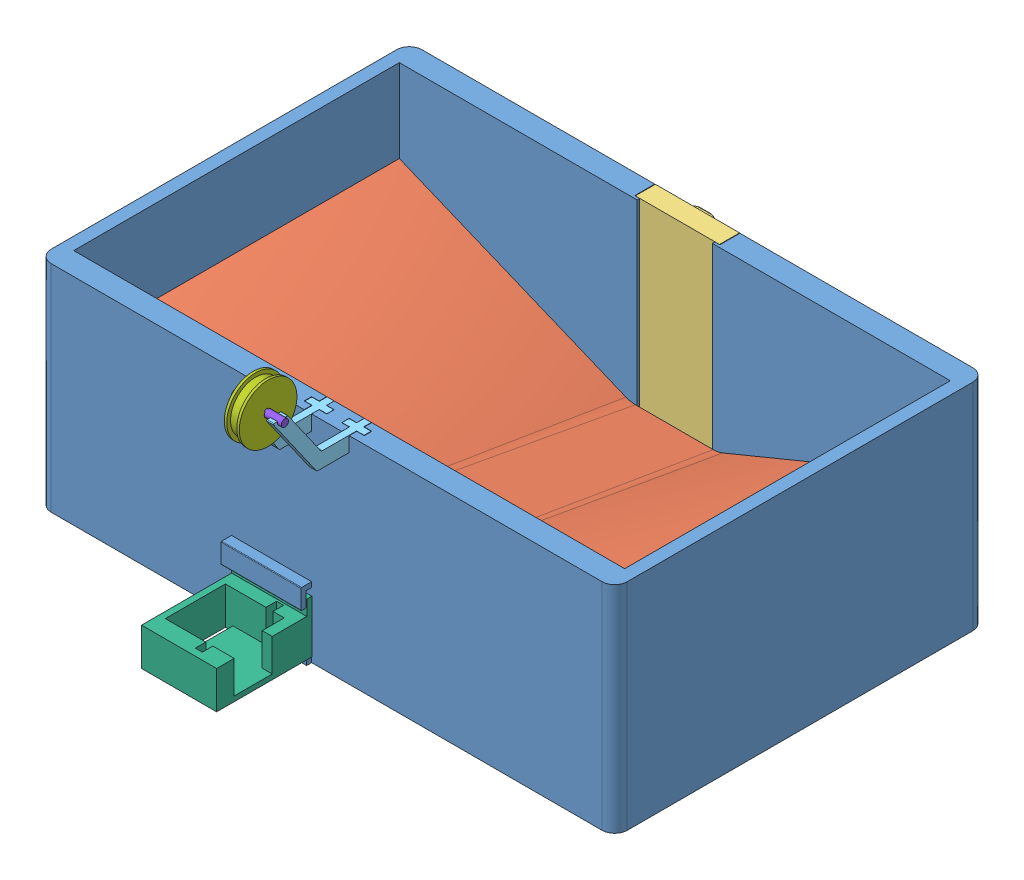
SolidWorks assembly insgesamt.SLDASM, configuration 默认 (file format 6000). Lengths in mm.
Overall size (230 119.92 193.93).
11 component instances, 8 part files, 11 mates.
Components (placement in the parent):
- box-1-1: box-1.SLDPRT [默认] at (-11.9703 -29.3033 229.9) size (230 86 152.2)
- schiefer-1: schiefer.SLDPRT [默认] at (-11.7703 -16.0671 294.9) size (219.6 40 129.6)
- tuer-1-1: tuer-1.SLDPRT [默认] at (-28.7703 -21.3003 163.897) x (1 0 0) z (0 0.000747 1) size (33.6 86 11.5)
- achse-1: achse.SLDPRT [默认] at (-28.9398 -25.3033 159.9) x (1 0 0) z (0 0.347763 0.937582) size (9 5.1 5.1)
- achse-2: achse.SLDPRT [默认] at (4.7017 -25.3033 159.9) x (-1 0 0) z (0 -0.995401 0.095798) size (9 5.1 5.1)
- stange-1: stange.SLDPRT [默认] at (-4.531 50.6967 294.9) size (8.8 25 39.07)
- stange-2: stange.SLDPRT [默认] at (-19.4095 50.6967 294.9) size (8.8 25 39.07)
- motor-box-3-1: motor-box-3.SLDPRT [默认] at (-32.9025 -27.2839 322.9) x (-1 0 0) z (0 0 -1) size (30 23 38)
- rad-oben-1: rad-oben.SLDASM [默认] at (-15.0948 85.3765 310.2291) x (1 0 0) z (0 -0.445497 0.895283) size (20 23 23)
  - rad-2-1: rad-2.SLDPRT [默认] at (3.694 0.0745 23) size (6 23 23)
  - achse-1-1: achse-1.SLDPRT [默认] at (3.3991 0.0745 23) size (20 3.41 2.9)
Mates (geometry in assembly coordinates):
- 同心1: concentric anti-aligned: cylinder of box-1-1 through (6.0297 -25.3033 159.9) axis (-1 0 0) radius 1.7; cylinder of tuer-1-1 through (-24.4703 -25.3033 159.9) axis (1 0 0) radius 2.75
- 距离4: distance = 0.2 mm anti-aligned: plane of tuer-1-1 through (4.8297 -21.3063 155.897) normal (1 0 0); plane of box-1-1 through (5.0297 56.6967 163.9) normal (-1 0 0)
- 同心2: concentric anti-aligned: cylinder of tuer-1-1 through (-24.4703 -25.3033 159.9) axis (1 0 0) radius 2.75; cylinder of achse-1 through (-19.9398 -25.3033 159.9) axis (-1 0 0) radius 2.55
- 同心3: concentric anti-aligned: cylinder of box-1-1 through (6.0297 -25.3033 159.9) axis (-1 0 0) radius 1.7; cylinder of achse-2 through (-4.2983 -25.3033 159.9) axis (1 0 0) radius 2.55
- 重合6: coincident aligned: plane of box-1-1 through (-121.9703 -29.3033 294.9) normal (0 0 -1); plane of stange-1 through (-3.131 50.6967 294.9) normal (0 0 -1)
- 重合7: coincident aligned: plane of box-1-1 through (-11.9703 56.6967 229.9) normal (0 1 0); plane of stange-1 through (-3.131 56.6967 294.9) normal (0 1 0)
- 重合8: coincident anti-aligned: plane of box-1-1 through (-126.9703 -29.3033 303.9) normal (0 0 1); plane of motor-box-3-1 through (-17.9025 -12.2839 303.9) normal (0 0 -1)
- 平行1: parallel aligned: plane of box-1-1 through (-11.9703 -29.3033 229.9) normal (0 -1 0); plane of motor-box-3-1 through (-32.9025 -27.2839 322.9) normal (0 -1 0)
- 重合11: coincident anti-aligned: plane of box-1-1 through (98.0297 -29.3033 164.9) normal (-1 0 0); plane of schiefer-1 through (98.0297 -16.0671 294.9) normal (1 0 0)
- 重合12: coincident anti-aligned: plane of box-1-1 through (-121.9703 -29.3033 294.9) normal (0 0 -1); plane of schiefer-1 through (5.7297 8.7849 294.9) normal (0 0 1)
- 同心4: concentric aligned: cylinder of stange-1 through (-0.131 75.1967 330.8538) axis (-1 0 0) radius 1.5; cylinder of rad-oben-1/achse-1-1 through (-9.6957 75.1967 330.8538) axis (-1 0 0) radius 1.45
